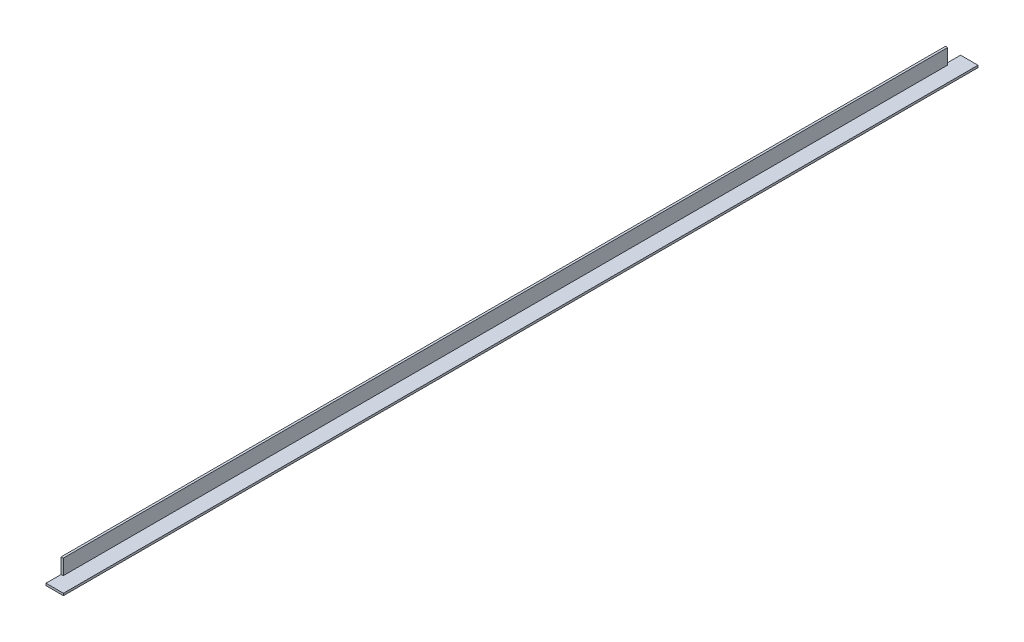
from build123d import *

# Parameters (mm, degrees)
BOSS_EXTRUDE1_DEPTH = 1934.21
SKETCH4_W           = 38.1
SKETCH4_H           = 4.7498
F_1_3_EXT_DEPTH     = 33.02
SKETCH5_W           = 38.1
SKETCH5_H           = 4.7498
BOSS_EXTRUDE5_DEPTH = 33.02


with BuildPart() as part:
    # Sketch1 → Boss-Extrude1 (new body)
    with BuildSketch(Plane.XY):
        Polygon((0, 0), (0, 38.1), (4.7498, 38.1), (4.7498, 4.7498), (38.1, 4.7498), (38.1, 0), align=None)
    extrude(amount=BOSS_EXTRUDE1_DEPTH)

    # Sketch4 → 1.3 ext (add)
    with BuildSketch(Plane(origin=(0, 0, 0), x_dir=(-1, 0, 0), z_dir=(0, 0, -1))):
        with Locations((-19.05, 2.3749)):
            Rectangle(SKETCH4_W, SKETCH4_H)
    extrude(amount=F_1_3_EXT_DEPTH)

    # Sketch5 → Boss-Extrude5 (add)
    with BuildSketch(Plane.XY.offset(1934.21)):
        with Locations((19.05, 2.3749)):
            Rectangle(SKETCH5_W, SKETCH5_H)
    extrude(amount=BOSS_EXTRUDE5_DEPTH)


solid = part.part
